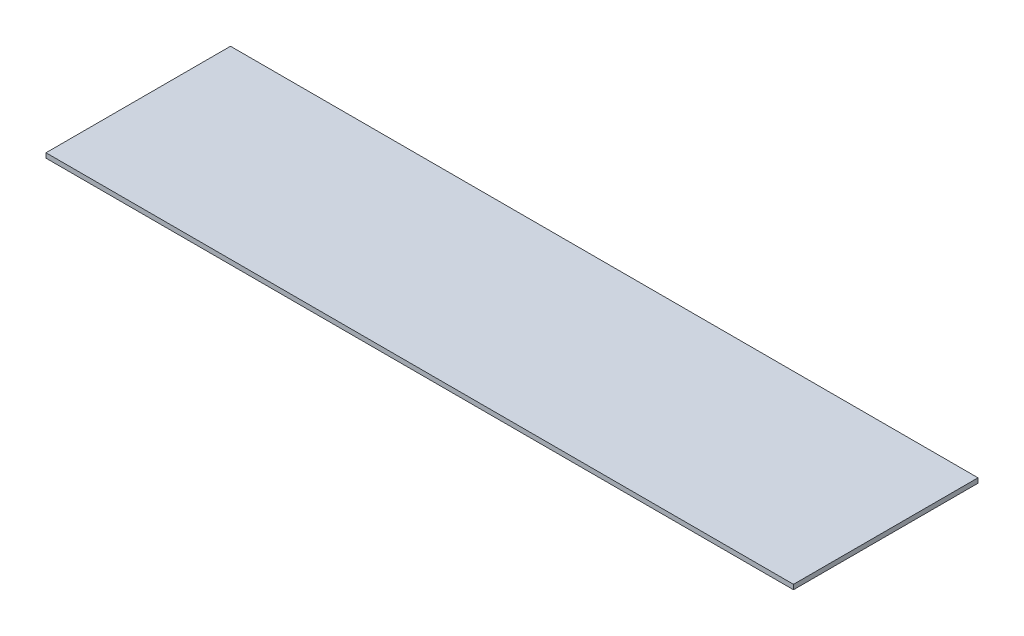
ISO-10303-21;
HEADER;
FILE_DESCRIPTION(('STEP AP214'),'2;1');
FILE_NAME('part.step','',(''),(''),'','','');
FILE_SCHEMA(('AUTOMOTIVE_DESIGN { 1 0 10303 214 1 1 1 1 }'));
ENDSEC;
DATA;
#1=APPLICATION_CONTEXT('core data for automotive mechanical design processes');
#2=APPLICATION_PROTOCOL_DEFINITION('international standard','automotive_design',2000,#1);
#3=PRODUCT_CONTEXT('',#1,'mechanical');
#4=PRODUCT('Part','Part','',(#3));
#5=PRODUCT_RELATED_PRODUCT_CATEGORY('part','',(#4));
#6=PRODUCT_DEFINITION_FORMATION('','',#4);
#7=PRODUCT_DEFINITION_CONTEXT('part definition',#1,'design');
#8=PRODUCT_DEFINITION('design','',#6,#7);
#9=PRODUCT_DEFINITION_SHAPE('','',#8);
#10=(LENGTH_UNIT() NAMED_UNIT(*) SI_UNIT(.MILLI.,.METRE.));
#11=(NAMED_UNIT(*) PLANE_ANGLE_UNIT() SI_UNIT($,.RADIAN.));
#12=(NAMED_UNIT(*) SI_UNIT($,.STERADIAN.) SOLID_ANGLE_UNIT());
#13=UNCERTAINTY_MEASURE_WITH_UNIT(LENGTH_MEASURE(1.E-05),#10,'distance_accuracy_value','');
#14=(GEOMETRIC_REPRESENTATION_CONTEXT(3) GLOBAL_UNCERTAINTY_ASSIGNED_CONTEXT((#13)) GLOBAL_UNIT_ASSIGNED_CONTEXT((#10,
#11,#12)) REPRESENTATION_CONTEXT('',''));
#15=CARTESIAN_POINT('',(0.,0.,0.));
#16=DIRECTION('',(0.,0.,1.));
#17=DIRECTION('',(1.,0.,0.));
#18=AXIS2_PLACEMENT_3D('',#15,#16,#17);
#19=CARTESIAN_POINT('',(501.65,6.35,123.825));
#20=DIRECTION('',(-1.,0.,0.));
#21=DIRECTION('',(0.,0.,1.));
#22=AXIS2_PLACEMENT_3D('',#19,#20,#21);
#23=PLANE('',#22);
#24=DIRECTION('',(0.,0.,-1.));
#25=VECTOR('',#24,1.);
#26=CARTESIAN_POINT('',(501.65,0.,123.825));
#27=LINE('',#26,#25);
#28=CARTESIAN_POINT('',(501.65,0.,123.825));
#29=VERTEX_POINT('',#28);
#30=CARTESIAN_POINT('',(501.65,0.,-123.825));
#31=VERTEX_POINT('',#30);
#32=EDGE_CURVE('E99',#29,#31,#27,.T.);
#33=ORIENTED_EDGE('',*,*,#32,.T.);
#34=DIRECTION('',(0.,-1.,0.));
#35=VECTOR('',#34,1.);
#36=CARTESIAN_POINT('',(501.65,6.35,-123.825));
#37=LINE('',#36,#35);
#38=CARTESIAN_POINT('',(501.65,6.35,-123.825));
#39=VERTEX_POINT('',#38);
#40=EDGE_CURVE('E11',#39,#31,#37,.T.);
#41=ORIENTED_EDGE('',*,*,#40,.F.);
#42=DIRECTION('',(0.,0.,-1.));
#43=VECTOR('',#42,1.);
#44=CARTESIAN_POINT('',(501.65,6.35,123.825));
#45=LINE('',#44,#43);
#46=CARTESIAN_POINT('',(501.65,6.35,123.825));
#47=VERTEX_POINT('',#46);
#48=EDGE_CURVE('E87',#47,#39,#45,.T.);
#49=ORIENTED_EDGE('',*,*,#48,.F.);
#50=DIRECTION('',(0.,-1.,0.));
#51=VECTOR('',#50,1.);
#52=CARTESIAN_POINT('',(501.65,6.35,123.825));
#53=LINE('',#52,#51);
#54=EDGE_CURVE('E95',#47,#29,#53,.T.);
#55=ORIENTED_EDGE('',*,*,#54,.T.);
#56=EDGE_LOOP('',(#33,#41,#49,#55));
#57=FACE_BOUND('',#56,.T.);
#58=ADVANCED_FACE('F36',(#57),#23,.F.);
#59=CARTESIAN_POINT('',(-501.65,6.35,-123.825));
#60=DIRECTION('',(0.,0.,1.));
#61=DIRECTION('',(1.,0.,0.));
#62=AXIS2_PLACEMENT_3D('',#59,#60,#61);
#63=PLANE('',#62);
#64=DIRECTION('',(-1.,0.,0.));
#65=VECTOR('',#64,1.);
#66=CARTESIAN_POINT('',(-501.65,0.,-123.825));
#67=LINE('',#66,#65);
#68=CARTESIAN_POINT('',(-501.65,0.,-123.825));
#69=VERTEX_POINT('',#68);
#70=EDGE_CURVE('E91',#31,#69,#67,.T.);
#71=ORIENTED_EDGE('',*,*,#70,.T.);
#72=DIRECTION('',(0.,-1.,0.));
#73=VECTOR('',#72,1.);
#74=CARTESIAN_POINT('',(-501.65,6.35,-123.825));
#75=LINE('',#74,#73);
#76=CARTESIAN_POINT('',(-501.65,6.35,-123.825));
#77=VERTEX_POINT('',#76);
#78=EDGE_CURVE('E44',#77,#69,#75,.T.);
#79=ORIENTED_EDGE('',*,*,#78,.F.);
#80=DIRECTION('',(-1.,0.,0.));
#81=VECTOR('',#80,1.);
#82=CARTESIAN_POINT('',(-501.65,6.35,-123.825));
#83=LINE('',#82,#81);
#84=EDGE_CURVE('E82',#39,#77,#83,.T.);
#85=ORIENTED_EDGE('',*,*,#84,.F.);
#86=ORIENTED_EDGE('',*,*,#40,.T.);
#87=EDGE_LOOP('',(#71,#79,#85,#86));
#88=FACE_BOUND('',#87,.T.);
#89=ADVANCED_FACE('F90',(#88),#63,.F.);
#90=CARTESIAN_POINT('',(-501.65,6.35,123.825));
#91=DIRECTION('',(1.,0.,0.));
#92=DIRECTION('',(0.,0.,-1.));
#93=AXIS2_PLACEMENT_3D('',#90,#91,#92);
#94=PLANE('',#93);
#95=DIRECTION('',(0.,0.,1.));
#96=VECTOR('',#95,1.);
#97=CARTESIAN_POINT('',(-501.65,0.,123.825));
#98=LINE('',#97,#96);
#99=CARTESIAN_POINT('',(-501.65,0.,123.825));
#100=VERTEX_POINT('',#99);
#101=EDGE_CURVE('E69',#69,#100,#98,.T.);
#102=ORIENTED_EDGE('',*,*,#101,.T.);
#103=DIRECTION('',(0.,-1.,0.));
#104=VECTOR('',#103,1.);
#105=CARTESIAN_POINT('',(-501.65,6.35,123.825));
#106=LINE('',#105,#104);
#107=CARTESIAN_POINT('',(-501.65,6.35,123.825));
#108=VERTEX_POINT('',#107);
#109=EDGE_CURVE('E92',#108,#100,#106,.T.);
#110=ORIENTED_EDGE('',*,*,#109,.F.);
#111=DIRECTION('',(0.,0.,1.));
#112=VECTOR('',#111,1.);
#113=CARTESIAN_POINT('',(-501.65,6.35,123.825));
#114=LINE('',#113,#112);
#115=EDGE_CURVE('E85',#77,#108,#114,.T.);
#116=ORIENTED_EDGE('',*,*,#115,.F.);
#117=ORIENTED_EDGE('',*,*,#78,.T.);
#118=EDGE_LOOP('',(#102,#110,#116,#117));
#119=FACE_BOUND('',#118,.T.);
#120=ADVANCED_FACE('F93',(#119),#94,.F.);
#121=CARTESIAN_POINT('',(-501.65,6.35,123.825));
#122=DIRECTION('',(0.,0.,-1.));
#123=DIRECTION('',(-1.,0.,0.));
#124=AXIS2_PLACEMENT_3D('',#121,#122,#123);
#125=PLANE('',#124);
#126=DIRECTION('',(1.,0.,0.));
#127=VECTOR('',#126,1.);
#128=CARTESIAN_POINT('',(-501.65,0.,123.825));
#129=LINE('',#128,#127);
#130=EDGE_CURVE('E75',#100,#29,#129,.T.);
#131=ORIENTED_EDGE('',*,*,#130,.T.);
#132=ORIENTED_EDGE('',*,*,#54,.F.);
#133=DIRECTION('',(1.,0.,0.));
#134=VECTOR('',#133,1.);
#135=CARTESIAN_POINT('',(-501.65,6.35,123.825));
#136=LINE('',#135,#134);
#137=EDGE_CURVE('E52',#108,#47,#136,.T.);
#138=ORIENTED_EDGE('',*,*,#137,.F.);
#139=ORIENTED_EDGE('',*,*,#109,.T.);
#140=EDGE_LOOP('',(#131,#132,#138,#139));
#141=FACE_BOUND('',#140,.T.);
#142=ADVANCED_FACE('F106',(#141),#125,.F.);
#143=CARTESIAN_POINT('',(0.,6.35,0.));
#144=DIRECTION('',(0.,-1.,0.));
#145=DIRECTION('',(0.,0.,-1.));
#146=AXIS2_PLACEMENT_3D('',#143,#144,#145);
#147=PLANE('',#146);
#148=ORIENTED_EDGE('',*,*,#48,.T.);
#149=ORIENTED_EDGE('',*,*,#84,.T.);
#150=ORIENTED_EDGE('',*,*,#115,.T.);
#151=ORIENTED_EDGE('',*,*,#137,.T.);
#152=EDGE_LOOP('',(#148,#149,#150,#151));
#153=FACE_BOUND('',#152,.T.);
#154=ADVANCED_FACE('F83',(#153),#147,.F.);
#155=CARTESIAN_POINT('',(0.,0.,0.));
#156=DIRECTION('',(0.,-1.,0.));
#157=DIRECTION('',(0.,0.,-1.));
#158=AXIS2_PLACEMENT_3D('',#155,#156,#157);
#159=PLANE('',#158);
#160=ORIENTED_EDGE('',*,*,#32,.F.);
#161=ORIENTED_EDGE('',*,*,#130,.F.);
#162=ORIENTED_EDGE('',*,*,#101,.F.);
#163=ORIENTED_EDGE('',*,*,#70,.F.);
#164=EDGE_LOOP('',(#160,#161,#162,#163));
#165=FACE_BOUND('',#164,.T.);
#166=ADVANCED_FACE('F109',(#165),#159,.T.);
#167=CLOSED_SHELL('',(#58,#89,#120,#142,#154,#166));
#168=MANIFOLD_SOLID_BREP('B2',#167);
#169=ADVANCED_BREP_SHAPE_REPRESENTATION('',(#18,#168),#14);
#170=SHAPE_DEFINITION_REPRESENTATION(#9,#169);
ENDSEC;
END-ISO-10303-21;
